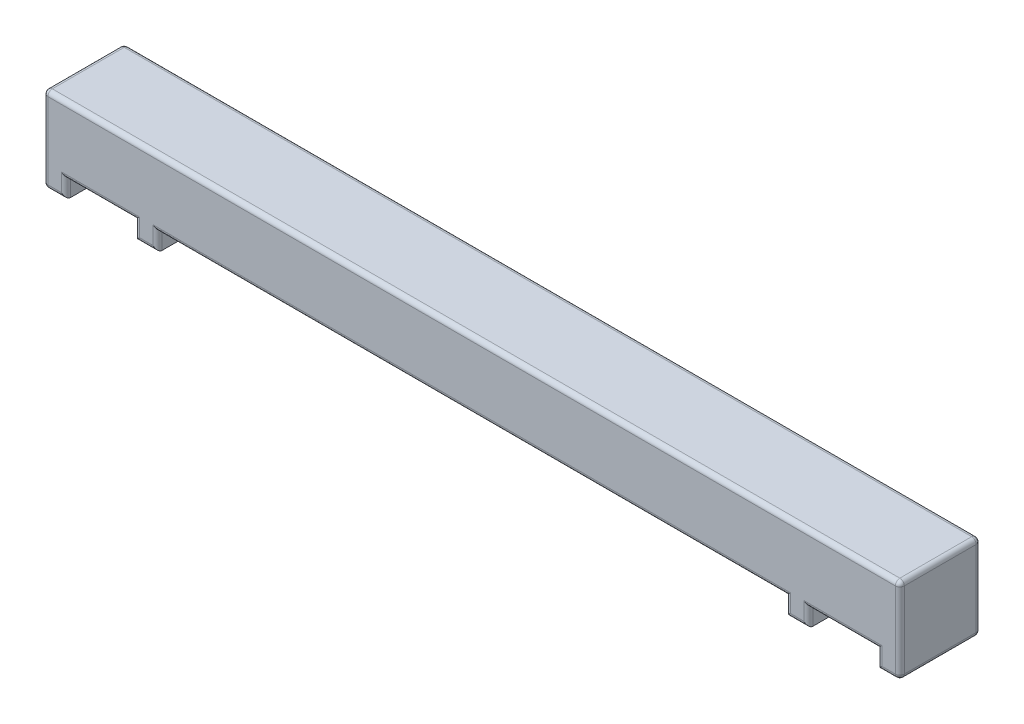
from build123d import *

# Parameters (mm, degrees)
SKETCH1_W           = 190.8
SKETCH1_H           = 18
BOSS_EXTRUDE1_DEPTH = 15
SKETCH4_W           = 5
SKETCH4_H           = 18
BOSS_EXTRUDE2_DEPTH = 4
FILLET2_R           = 1


with BuildPart() as part:
    # Sketch1 → Boss-Extrude1 (new body)
    with BuildSketch(Plane(origin=(0, 0, 0), x_dir=(1, 0, 0), z_dir=(0, 1, 0))):
        Rectangle(SKETCH1_W, SKETCH1_H)
    extrude(amount=BOSS_EXTRUDE1_DEPTH)

    # Sketch4 → Boss-Extrude2 (add)
    with BuildSketch(Plane.XZ):
        with Locations((-92.9, 0)):
            Rectangle(SKETCH4_W, SKETCH4_H)
        with Locations((-72.5, 0)):
            Rectangle(SKETCH4_W, SKETCH4_H)
        with Locations((92.9, 0)):
            Rectangle(SKETCH4_W, SKETCH4_H)
        with Locations((72.5, 0)):
            Rectangle(SKETCH4_W, SKETCH4_H)
    extrude(amount=BOSS_EXTRUDE2_DEPTH)

    # Fillet2
    fillet2_edges = [part.edges().sort_by_distance(p)[0] for p in [
        (-95.4, 15, 0),
        (-82.7, 0, 9),
        (-90.4, -2, -9),
        (-90.4, -2, 9),
        (-95.4, -4, 0),
        (0, 15, 9),
        (-92.9, -4, -9),
        (-92.9, -4, 9),
        (0, 0, 9),
        (-82.7, 0, -9),
        (-75, -2, 9),
        (-75, -2, -9),
        (-70, -2, -9),
        (-70, -2, 9),
        (-72.5, -4, -9),
        (-72.5, -4, 9),
        (82.7, 0, -9),
        (90.4, -2, 9),
        (90.4, -2, -9),
        (95.4, -4, 0),
        (92.9, -4, 9),
        (92.9, -4, -9),
        (82.7, 0, 9),
        (0, 0, -9),
        (75, -2, -9),
        (75, -2, 9),
        (70, -2, 9),
        (95.4, 15, 0),
        (70, -2, -9),
        (72.5, -4, 9),
        (72.5, -4, -9),
        (95.4, 5.5, 9),
        (-95.4, 5.5, 9),
        (-95.4, 5.5, -9),
        (95.4, 5.5, -9),
        (0, 15, -9),
    ]]
    fillet(fillet2_edges, radius=FILLET2_R)


solid = part.part
